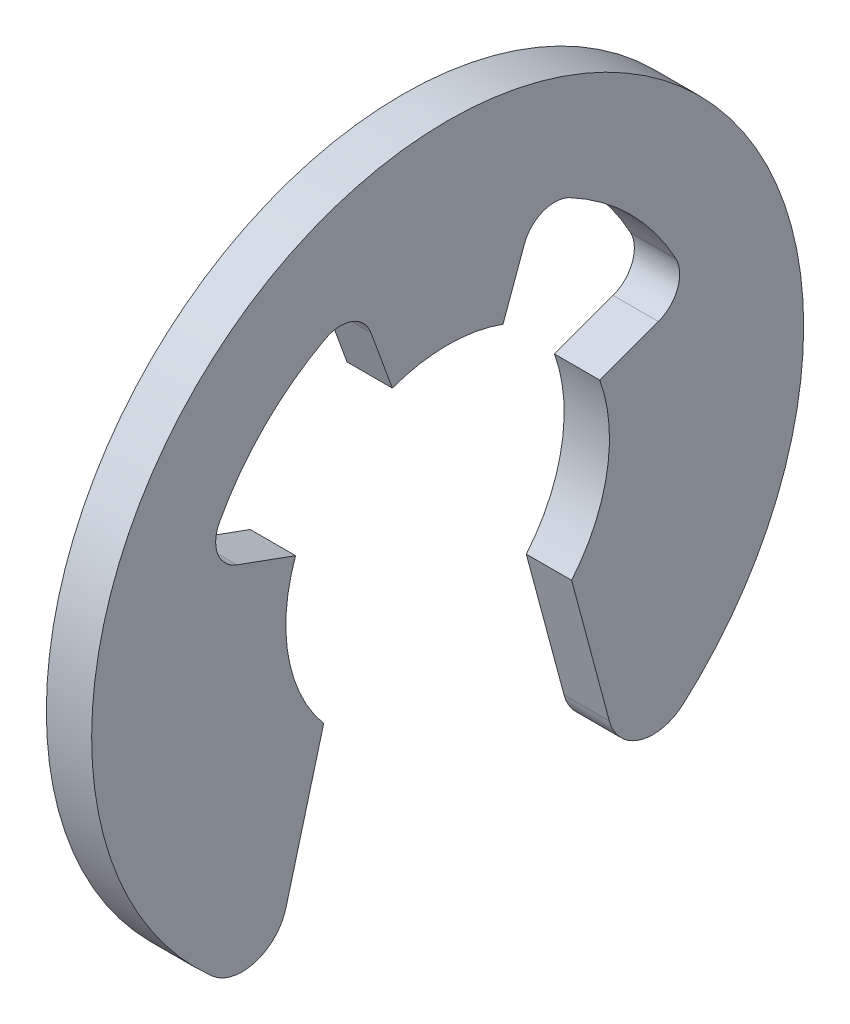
ISO-10303-21;
HEADER;
FILE_DESCRIPTION(('STEP AP214'),'2;1');
FILE_NAME('part.step','',(''),(''),'','','');
FILE_SCHEMA(('AUTOMOTIVE_DESIGN { 1 0 10303 214 1 1 1 1 }'));
ENDSEC;
DATA;
#1=APPLICATION_CONTEXT('core data for automotive mechanical design processes');
#2=APPLICATION_PROTOCOL_DEFINITION('international standard','automotive_design',2000,#1);
#3=PRODUCT_CONTEXT('',#1,'mechanical');
#4=PRODUCT('Part','Part','',(#3));
#5=PRODUCT_RELATED_PRODUCT_CATEGORY('part','',(#4));
#6=PRODUCT_DEFINITION_FORMATION('','',#4);
#7=PRODUCT_DEFINITION_CONTEXT('part definition',#1,'design');
#8=PRODUCT_DEFINITION('design','',#6,#7);
#9=PRODUCT_DEFINITION_SHAPE('','',#8);
#10=(LENGTH_UNIT() NAMED_UNIT(*) SI_UNIT(.MILLI.,.METRE.));
#11=(NAMED_UNIT(*) PLANE_ANGLE_UNIT() SI_UNIT($,.RADIAN.));
#12=(NAMED_UNIT(*) SI_UNIT($,.STERADIAN.) SOLID_ANGLE_UNIT());
#13=UNCERTAINTY_MEASURE_WITH_UNIT(LENGTH_MEASURE(1.E-05),#10,'distance_accuracy_value','');
#14=(GEOMETRIC_REPRESENTATION_CONTEXT(3) GLOBAL_UNCERTAINTY_ASSIGNED_CONTEXT((#13)) GLOBAL_UNIT_ASSIGNED_CONTEXT((#10,
#11,#12)) REPRESENTATION_CONTEXT('',''));
#15=CARTESIAN_POINT('',(0.,0.,0.));
#16=DIRECTION('',(0.,0.,1.));
#17=DIRECTION('',(1.,0.,0.));
#18=AXIS2_PLACEMENT_3D('',#15,#16,#17);
#19=CARTESIAN_POINT('',(0.7,0.,0.));
#20=DIRECTION('',(1.,0.,0.));
#21=DIRECTION('',(0.,0.,-1.));
#22=AXIS2_PLACEMENT_3D('',#19,#20,#21);
#23=PLANE('',#22);
#24=CARTESIAN_POINT('',(0.7,0.,0.));
#25=DIRECTION('',(1.,0.,0.));
#26=DIRECTION('',(0.,0.,-1.));
#27=AXIS2_PLACEMENT_3D('',#24,#25,#26);
#28=CIRCLE('',#27,4.);
#29=CARTESIAN_POINT('',(0.7,3.52477788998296,-1.89101581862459));
#30=VERTEX_POINT('',#29);
#31=CARTESIAN_POINT('',(0.7,1.89101581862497,-3.52477788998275));
#32=VERTEX_POINT('',#31);
#33=EDGE_CURVE('E153',#30,#32,#28,.F.);
#34=ORIENTED_EDGE('',*,*,#33,.T.);
#35=CARTESIAN_POINT('',(0.7,1.654638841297,-3.084180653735));
#36=DIRECTION('',(1.,0.,0.));
#37=DIRECTION('',(0.,0.,-1.));
#38=AXIS2_PLACEMENT_3D('',#35,#36,#37);
#39=CIRCLE('',#38,0.5);
#40=CARTESIAN_POINT('',(0.7,1.18479253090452,-3.25519072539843));
#41=VERTEX_POINT('',#40);
#42=EDGE_CURVE('E20',#32,#41,#39,.F.);
#43=ORIENTED_EDGE('',*,*,#42,.T.);
#44=DIRECTION('',(0.,-0.342020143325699,0.939692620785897));
#45=VECTOR('',#44,1.);
#46=CARTESIAN_POINT('',(0.7,1.184792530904,-3.255190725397));
#47=LINE('',#46,#45);
#48=CARTESIAN_POINT('',(0.7,0.85505035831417,-2.34923155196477));
#49=VERTEX_POINT('',#48);
#50=EDGE_CURVE('E140',#49,#41,#47,.F.);
#51=ORIENTED_EDGE('',*,*,#50,.F.);
#52=CARTESIAN_POINT('',(0.7,0.,0.));
#53=DIRECTION('',(1.,0.,0.));
#54=DIRECTION('',(0.,0.,-1.));
#55=AXIS2_PLACEMENT_3D('',#52,#53,#54);
#56=CIRCLE('',#55,2.5);
#57=CARTESIAN_POINT('',(0.7,-1.60696902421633,-1.91511110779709));
#58=VERTEX_POINT('',#57);
#59=EDGE_CURVE('E160',#49,#58,#56,.F.);
#60=ORIENTED_EDGE('',*,*,#59,.T.);
#61=DIRECTION('',(0.,-0.965925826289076,-0.258819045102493));
#62=VECTOR('',#61,1.);
#63=CARTESIAN_POINT('',(0.7,-1.606969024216,-1.915111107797));
#64=LINE('',#63,#62);
#65=CARTESIAN_POINT('',(0.7,-3.78193368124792,-2.49789113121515));
#66=VERTEX_POINT('',#65);
#67=EDGE_CURVE('E180',#66,#58,#64,.F.);
#68=ORIENTED_EDGE('',*,*,#67,.F.);
#69=CARTESIAN_POINT('',(0.7,-3.600760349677,-3.174039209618));
#70=DIRECTION('',(1.,0.,0.));
#71=DIRECTION('',(0.,0.,-1.));
#72=AXIS2_PLACEMENT_3D('',#69,#70,#71);
#73=CIRCLE('',#72,0.7);
#74=CARTESIAN_POINT('',(0.7,-4.12587123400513,-3.6369199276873));
#75=VERTEX_POINT('',#74);
#76=EDGE_CURVE('E242',#75,#66,#73,.F.);
#77=ORIENTED_EDGE('',*,*,#76,.F.);
#78=CARTESIAN_POINT('',(0.7,0.,0.));
#79=DIRECTION('',(1.,0.,0.));
#80=DIRECTION('',(0.,0.,-1.));
#81=AXIS2_PLACEMENT_3D('',#78,#79,#80);
#82=CIRCLE('',#81,5.5);
#83=CARTESIAN_POINT('',(0.7,-4.12587123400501,3.6369199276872));
#84=VERTEX_POINT('',#83);
#85=EDGE_CURVE('E239',#84,#75,#82,.F.);
#86=ORIENTED_EDGE('',*,*,#85,.F.);
#87=CARTESIAN_POINT('',(0.7,-3.600760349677,3.174039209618));
#88=DIRECTION('',(1.,0.,0.));
#89=DIRECTION('',(0.,0.,-1.));
#90=AXIS2_PLACEMENT_3D('',#87,#88,#89);
#91=CIRCLE('',#90,0.7);
#92=CARTESIAN_POINT('',(0.7,-3.7819336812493,2.49789113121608));
#93=VERTEX_POINT('',#92);
#94=EDGE_CURVE('E235',#93,#84,#91,.F.);
#95=ORIENTED_EDGE('',*,*,#94,.F.);
#96=DIRECTION('',(0.,0.965925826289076,-0.258819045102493));
#97=VECTOR('',#96,1.);
#98=CARTESIAN_POINT('',(0.7,-3.781933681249,2.497891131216));
#99=LINE('',#98,#97);
#100=CARTESIAN_POINT('',(0.7,-1.60696902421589,1.91511110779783));
#101=VERTEX_POINT('',#100);
#102=EDGE_CURVE('E176',#101,#93,#99,.F.);
#103=ORIENTED_EDGE('',*,*,#102,.F.);
#104=CARTESIAN_POINT('',(0.7,0.,0.));
#105=DIRECTION('',(1.,0.,0.));
#106=DIRECTION('',(0.,0.,-1.));
#107=AXIS2_PLACEMENT_3D('',#104,#105,#106);
#108=CIRCLE('',#107,2.5);
#109=CARTESIAN_POINT('',(0.7,0.855050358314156,2.34923155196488));
#110=VERTEX_POINT('',#109);
#111=EDGE_CURVE('E175',#101,#110,#108,.F.);
#112=ORIENTED_EDGE('',*,*,#111,.T.);
#113=DIRECTION('',(0.,0.342020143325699,0.939692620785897));
#114=VECTOR('',#113,1.);
#115=CARTESIAN_POINT('',(0.7,0.8550503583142,2.349231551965));
#116=LINE('',#115,#114);
#117=CARTESIAN_POINT('',(0.7,1.18479253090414,3.25519072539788));
#118=VERTEX_POINT('',#117);
#119=EDGE_CURVE('E172',#118,#110,#116,.F.);
#120=ORIENTED_EDGE('',*,*,#119,.F.);
#121=CARTESIAN_POINT('',(0.7,1.654638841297,3.084180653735));
#122=DIRECTION('',(1.,0.,0.));
#123=DIRECTION('',(0.,0.,-1.));
#124=AXIS2_PLACEMENT_3D('',#121,#122,#123);
#125=CIRCLE('',#124,0.5);
#126=CARTESIAN_POINT('',(0.7,1.89101581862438,3.52477788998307));
#127=VERTEX_POINT('',#126);
#128=EDGE_CURVE('E229',#118,#127,#125,.F.);
#129=ORIENTED_EDGE('',*,*,#128,.T.);
#130=CARTESIAN_POINT('',(0.7,0.,0.));
#131=DIRECTION('',(1.,0.,0.));
#132=DIRECTION('',(0.,0.,-1.));
#133=AXIS2_PLACEMENT_3D('',#130,#131,#132);
#134=CIRCLE('',#133,4.);
#135=CARTESIAN_POINT('',(0.7,3.52477788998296,1.89101581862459));
#136=VERTEX_POINT('',#135);
#137=EDGE_CURVE('E226',#127,#136,#134,.F.);
#138=ORIENTED_EDGE('',*,*,#137,.T.);
#139=CARTESIAN_POINT('',(0.7,3.084180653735,1.654638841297));
#140=DIRECTION('',(1.,0.,0.));
#141=DIRECTION('',(0.,0.,-1.));
#142=AXIS2_PLACEMENT_3D('',#139,#140,#141);
#143=CIRCLE('',#142,0.5);
#144=CARTESIAN_POINT('',(0.7,3.25519072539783,1.1847925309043));
#145=VERTEX_POINT('',#144);
#146=EDGE_CURVE('E171',#136,#145,#143,.F.);
#147=ORIENTED_EDGE('',*,*,#146,.T.);
#148=DIRECTION('',(0.,-0.939692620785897,-0.342020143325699));
#149=VECTOR('',#148,1.);
#150=CARTESIAN_POINT('',(0.7,3.255190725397,1.184792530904));
#151=LINE('',#150,#149);
#152=CARTESIAN_POINT('',(0.7,2.34923155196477,0.85505035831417));
#153=VERTEX_POINT('',#152);
#154=EDGE_CURVE('E168',#153,#145,#151,.F.);
#155=ORIENTED_EDGE('',*,*,#154,.F.);
#156=CARTESIAN_POINT('',(0.7,0.,0.));
#157=DIRECTION('',(1.,0.,0.));
#158=DIRECTION('',(0.,0.,-1.));
#159=AXIS2_PLACEMENT_3D('',#156,#157,#158);
#160=CIRCLE('',#159,2.5);
#161=CARTESIAN_POINT('',(0.7,2.34923155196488,-0.855050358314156));
#162=VERTEX_POINT('',#161);
#163=EDGE_CURVE('E167',#153,#162,#160,.F.);
#164=ORIENTED_EDGE('',*,*,#163,.T.);
#165=DIRECTION('',(0.,0.939692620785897,-0.342020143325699));
#166=VECTOR('',#165,1.);
#167=CARTESIAN_POINT('',(0.7,2.349231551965,-0.8550503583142));
#168=LINE('',#167,#166);
#169=CARTESIAN_POINT('',(0.7,3.25519072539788,-1.18479253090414));
#170=VERTEX_POINT('',#169);
#171=EDGE_CURVE('E164',#170,#162,#168,.F.);
#172=ORIENTED_EDGE('',*,*,#171,.F.);
#173=CARTESIAN_POINT('',(0.7,3.084180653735,-1.654638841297));
#174=DIRECTION('',(1.,0.,0.));
#175=DIRECTION('',(0.,0.,-1.));
#176=AXIS2_PLACEMENT_3D('',#173,#174,#175);
#177=CIRCLE('',#176,0.5);
#178=EDGE_CURVE('E217',#170,#30,#177,.F.);
#179=ORIENTED_EDGE('',*,*,#178,.T.);
#180=EDGE_LOOP('',(#34,#43,#51,#60,#68,#77,#86,#95,#103,#112,#120,#129,#138,#147,#155,#164,#172,#179));
#181=FACE_BOUND('',#180,.T.);
#182=ADVANCED_FACE('F16',(#181),#23,.T.);
#183=CARTESIAN_POINT('',(0.,1.654638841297,-3.084180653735));
#184=DIRECTION('',(1.,0.,0.));
#185=DIRECTION('',(0.,0.,-1.));
#186=AXIS2_PLACEMENT_3D('',#183,#184,#185);
#187=CYLINDRICAL_SURFACE('',#186,0.5);
#188=ORIENTED_EDGE('',*,*,#42,.F.);
#189=DIRECTION('',(1.,0.,0.));
#190=VECTOR('',#189,1.);
#191=CARTESIAN_POINT('',(0.,1.89101581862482,-3.52477788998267));
#192=LINE('',#191,#190);
#193=CARTESIAN_POINT('',(0.,1.89101581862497,-3.52477788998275));
#194=VERTEX_POINT('',#193);
#195=EDGE_CURVE('E215',#32,#194,#192,.F.);
#196=ORIENTED_EDGE('',*,*,#195,.T.);
#197=CARTESIAN_POINT('',(0.,1.654638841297,-3.084180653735));
#198=DIRECTION('',(1.,0.,0.));
#199=DIRECTION('',(0.,0.,-1.));
#200=AXIS2_PLACEMENT_3D('',#197,#198,#199);
#201=CIRCLE('',#200,0.5);
#202=CARTESIAN_POINT('',(0.,1.18479253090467,-3.25519072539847));
#203=VERTEX_POINT('',#202);
#204=EDGE_CURVE('E158',#194,#203,#201,.F.);
#205=ORIENTED_EDGE('',*,*,#204,.T.);
#206=DIRECTION('',(1.,0.,0.));
#207=VECTOR('',#206,1.);
#208=CARTESIAN_POINT('',(0.,1.18479253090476,-3.25519072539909));
#209=LINE('',#208,#207);
#210=EDGE_CURVE('E145',#41,#203,#209,.F.);
#211=ORIENTED_EDGE('',*,*,#210,.F.);
#212=EDGE_LOOP('',(#188,#196,#205,#211));
#213=FACE_BOUND('',#212,.T.);
#214=ADVANCED_FACE('F157',(#213),#187,.F.);
#215=CARTESIAN_POINT('',(0.,1.184792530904,-3.255190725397));
#216=DIRECTION('',(0.,0.939692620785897,0.342020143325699));
#217=DIRECTION('',(0.,-0.342020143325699,0.939692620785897));
#218=AXIS2_PLACEMENT_3D('',#215,#216,#217);
#219=PLANE('',#218);
#220=ORIENTED_EDGE('',*,*,#210,.T.);
#221=DIRECTION('',(0.,-0.342020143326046,0.939692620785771));
#222=VECTOR('',#221,1.);
#223=CARTESIAN_POINT('',(0.,1.184792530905,-3.255190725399));
#224=LINE('',#223,#222);
#225=CARTESIAN_POINT('',(0.,0.855050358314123,-2.34923155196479));
#226=VERTEX_POINT('',#225);
#227=EDGE_CURVE('E213',#203,#226,#224,.T.);
#228=ORIENTED_EDGE('',*,*,#227,.T.);
#229=DIRECTION('',(1.,0.,0.));
#230=VECTOR('',#229,1.);
#231=CARTESIAN_POINT('',(0.,0.855050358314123,-2.34923155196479));
#232=LINE('',#231,#230);
#233=EDGE_CURVE('E147',#226,#49,#232,.T.);
#234=ORIENTED_EDGE('',*,*,#233,.T.);
#235=ORIENTED_EDGE('',*,*,#50,.T.);
#236=EDGE_LOOP('',(#220,#228,#234,#235));
#237=FACE_BOUND('',#236,.T.);
#238=ADVANCED_FACE('F142',(#237),#219,.T.);
#239=CARTESIAN_POINT('',(0.,0.,0.));
#240=DIRECTION('',(1.,0.,0.));
#241=DIRECTION('',(0.,0.,-1.));
#242=AXIS2_PLACEMENT_3D('',#239,#240,#241);
#243=CYLINDRICAL_SURFACE('',#242,2.5);
#244=ORIENTED_EDGE('',*,*,#59,.F.);
#245=ORIENTED_EDGE('',*,*,#233,.F.);
#246=CARTESIAN_POINT('',(0.,0.,0.));
#247=DIRECTION('',(1.,0.,0.));
#248=DIRECTION('',(0.,0.,-1.));
#249=AXIS2_PLACEMENT_3D('',#246,#247,#248);
#250=CIRCLE('',#249,2.5);
#251=CARTESIAN_POINT('',(0.,-1.60696902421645,-1.91511110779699));
#252=VERTEX_POINT('',#251);
#253=EDGE_CURVE('E211',#226,#252,#250,.F.);
#254=ORIENTED_EDGE('',*,*,#253,.T.);
#255=DIRECTION('',(1.,0.,0.));
#256=VECTOR('',#255,1.);
#257=CARTESIAN_POINT('',(0.,-1.606969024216,-1.915111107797));
#258=LINE('',#257,#256);
#259=EDGE_CURVE('E181',#58,#252,#258,.F.);
#260=ORIENTED_EDGE('',*,*,#259,.F.);
#261=EDGE_LOOP('',(#244,#245,#254,#260));
#262=FACE_BOUND('',#261,.T.);
#263=ADVANCED_FACE('F249',(#262),#243,.F.);
#264=CARTESIAN_POINT('',(0.,-1.606969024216,-1.915111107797));
#265=DIRECTION('',(0.,-0.258819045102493,0.965925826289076));
#266=DIRECTION('',(0.,-0.965925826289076,-0.258819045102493));
#267=AXIS2_PLACEMENT_3D('',#264,#265,#266);
#268=PLANE('',#267);
#269=ORIENTED_EDGE('',*,*,#259,.T.);
#270=DIRECTION('',(0.,-0.965925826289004,-0.25881904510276));
#271=VECTOR('',#270,1.);
#272=CARTESIAN_POINT('',(0.,-1.606969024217,-1.915111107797));
#273=LINE('',#272,#271);
#274=CARTESIAN_POINT('',(0.,-3.78193368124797,-2.49789113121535));
#275=VERTEX_POINT('',#274);
#276=EDGE_CURVE('E210',#252,#275,#273,.T.);
#277=ORIENTED_EDGE('',*,*,#276,.T.);
#278=DIRECTION('',(1.,0.,0.));
#279=VECTOR('',#278,1.);
#280=CARTESIAN_POINT('',(0.,-3.78193368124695,-2.49789113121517));
#281=LINE('',#280,#279);
#282=EDGE_CURVE('E241',#66,#275,#281,.F.);
#283=ORIENTED_EDGE('',*,*,#282,.F.);
#284=ORIENTED_EDGE('',*,*,#67,.T.);
#285=EDGE_LOOP('',(#269,#277,#283,#284));
#286=FACE_BOUND('',#285,.T.);
#287=ADVANCED_FACE('F336',(#286),#268,.T.);
#288=CARTESIAN_POINT('',(0.,-3.600760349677,-3.174039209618));
#289=DIRECTION('',(1.,0.,0.));
#290=DIRECTION('',(0.,0.,-1.));
#291=AXIS2_PLACEMENT_3D('',#288,#289,#290);
#292=CYLINDRICAL_SURFACE('',#291,0.7);
#293=ORIENTED_EDGE('',*,*,#282,.T.);
#294=CARTESIAN_POINT('',(0.,-3.600760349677,-3.174039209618));
#295=DIRECTION('',(1.,0.,0.));
#296=DIRECTION('',(0.,0.,-1.));
#297=AXIS2_PLACEMENT_3D('',#294,#295,#296);
#298=CIRCLE('',#297,0.7);
#299=CARTESIAN_POINT('',(0.,-4.12587123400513,-3.6369199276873));
#300=VERTEX_POINT('',#299);
#301=EDGE_CURVE('E207',#275,#300,#298,.T.);
#302=ORIENTED_EDGE('',*,*,#301,.T.);
#303=DIRECTION('',(1.,0.,0.));
#304=VECTOR('',#303,1.);
#305=CARTESIAN_POINT('',(0.,-4.12587123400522,-3.63691992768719));
#306=LINE('',#305,#304);
#307=EDGE_CURVE('E238',#75,#300,#306,.F.);
#308=ORIENTED_EDGE('',*,*,#307,.F.);
#309=ORIENTED_EDGE('',*,*,#76,.T.);
#310=EDGE_LOOP('',(#293,#302,#308,#309));
#311=FACE_BOUND('',#310,.T.);
#312=ADVANCED_FACE('F335',(#311),#292,.T.);
#313=CARTESIAN_POINT('',(0.,0.,0.));
#314=DIRECTION('',(1.,0.,0.));
#315=DIRECTION('',(0.,0.,-1.));
#316=AXIS2_PLACEMENT_3D('',#313,#314,#315);
#317=CYLINDRICAL_SURFACE('',#316,5.5);
#318=CARTESIAN_POINT('',(0.,0.,0.));
#319=DIRECTION('',(1.,0.,0.));
#320=DIRECTION('',(0.,0.,-1.));
#321=AXIS2_PLACEMENT_3D('',#318,#319,#320);
#322=CIRCLE('',#321,5.5);
#323=CARTESIAN_POINT('',(0.,-4.12587123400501,3.6369199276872));
#324=VERTEX_POINT('',#323);
#325=EDGE_CURVE('E205',#300,#324,#322,.T.);
#326=ORIENTED_EDGE('',*,*,#325,.T.);
#327=DIRECTION('',(1.,0.,0.));
#328=VECTOR('',#327,1.);
#329=CARTESIAN_POINT('',(0.,-4.1258712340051,3.63691992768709));
#330=LINE('',#329,#328);
#331=EDGE_CURVE('E179',#84,#324,#330,.F.);
#332=ORIENTED_EDGE('',*,*,#331,.F.);
#333=ORIENTED_EDGE('',*,*,#85,.T.);
#334=ORIENTED_EDGE('',*,*,#307,.T.);
#335=EDGE_LOOP('',(#326,#332,#333,#334));
#336=FACE_BOUND('',#335,.T.);
#337=ADVANCED_FACE('F369',(#336),#317,.T.);
#338=CARTESIAN_POINT('',(0.,-3.600760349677,3.174039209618));
#339=DIRECTION('',(1.,0.,0.));
#340=DIRECTION('',(0.,0.,-1.));
#341=AXIS2_PLACEMENT_3D('',#338,#339,#340);
#342=CYLINDRICAL_SURFACE('',#341,0.7);
#343=ORIENTED_EDGE('',*,*,#331,.T.);
#344=CARTESIAN_POINT('',(0.,-3.600760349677,3.174039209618));
#345=DIRECTION('',(1.,0.,0.));
#346=DIRECTION('',(0.,0.,-1.));
#347=AXIS2_PLACEMENT_3D('',#344,#345,#346);
#348=CIRCLE('',#347,0.7);
#349=CARTESIAN_POINT('',(0.,-3.78193368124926,2.49789113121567));
#350=VERTEX_POINT('',#349);
#351=EDGE_CURVE('E202',#324,#350,#348,.T.);
#352=ORIENTED_EDGE('',*,*,#351,.T.);
#353=DIRECTION('',(1.,0.,0.));
#354=VECTOR('',#353,1.);
#355=CARTESIAN_POINT('',(0.,-3.78193368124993,2.49789113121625));
#356=LINE('',#355,#354);
#357=EDGE_CURVE('E178',#93,#350,#356,.F.);
#358=ORIENTED_EDGE('',*,*,#357,.F.);
#359=ORIENTED_EDGE('',*,*,#94,.T.);
#360=EDGE_LOOP('',(#343,#352,#358,#359));
#361=FACE_BOUND('',#360,.T.);
#362=ADVANCED_FACE('F328',(#361),#342,.T.);
#363=CARTESIAN_POINT('',(0.,-3.781933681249,2.497891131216));
#364=DIRECTION('',(0.,-0.258819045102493,-0.965925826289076));
#365=DIRECTION('',(0.,0.965925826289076,-0.258819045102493));
#366=AXIS2_PLACEMENT_3D('',#363,#364,#365);
#367=PLANE('',#366);
#368=ORIENTED_EDGE('',*,*,#357,.T.);
#369=DIRECTION('',(0.,0.965925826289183,-0.258819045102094));
#370=VECTOR('',#369,1.);
#371=CARTESIAN_POINT('',(0.,-3.781933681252,2.497891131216));
#372=LINE('',#371,#370);
#373=CARTESIAN_POINT('',(0.,-1.60696902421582,1.91511110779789));
#374=VERTEX_POINT('',#373);
#375=EDGE_CURVE('E201',#350,#374,#372,.T.);
#376=ORIENTED_EDGE('',*,*,#375,.T.);
#377=DIRECTION('',(1.,0.,0.));
#378=VECTOR('',#377,1.);
#379=CARTESIAN_POINT('',(0.,-1.60696902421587,1.91511110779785));
#380=LINE('',#379,#378);
#381=EDGE_CURVE('E234',#374,#101,#380,.T.);
#382=ORIENTED_EDGE('',*,*,#381,.T.);
#383=ORIENTED_EDGE('',*,*,#102,.T.);
#384=EDGE_LOOP('',(#368,#376,#382,#383));
#385=FACE_BOUND('',#384,.T.);
#386=ADVANCED_FACE('F324',(#385),#367,.T.);
#387=CARTESIAN_POINT('',(0.,0.,0.));
#388=DIRECTION('',(1.,0.,0.));
#389=DIRECTION('',(0.,0.,-1.));
#390=AXIS2_PLACEMENT_3D('',#387,#388,#389);
#391=CYLINDRICAL_SURFACE('',#390,2.5);
#392=ORIENTED_EDGE('',*,*,#111,.F.);
#393=ORIENTED_EDGE('',*,*,#381,.F.);
#394=CARTESIAN_POINT('',(0.,0.,0.));
#395=DIRECTION('',(1.,0.,0.));
#396=DIRECTION('',(0.,0.,-1.));
#397=AXIS2_PLACEMENT_3D('',#394,#395,#396);
#398=CIRCLE('',#397,2.5);
#399=CARTESIAN_POINT('',(0.,0.855050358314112,2.34923155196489));
#400=VERTEX_POINT('',#399);
#401=EDGE_CURVE('E199',#374,#400,#398,.F.);
#402=ORIENTED_EDGE('',*,*,#401,.T.);
#403=DIRECTION('',(1.,0.,0.));
#404=VECTOR('',#403,1.);
#405=CARTESIAN_POINT('',(0.,0.855050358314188,2.34923155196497));
#406=LINE('',#405,#404);
#407=EDGE_CURVE('E174',#110,#400,#406,.F.);
#408=ORIENTED_EDGE('',*,*,#407,.F.);
#409=EDGE_LOOP('',(#392,#393,#402,#408));
#410=FACE_BOUND('',#409,.T.);
#411=ADVANCED_FACE('F319',(#410),#391,.F.);
#412=CARTESIAN_POINT('',(0.,0.8550503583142,2.349231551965));
#413=DIRECTION('',(0.,0.939692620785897,-0.342020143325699));
#414=DIRECTION('',(0.,0.342020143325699,0.939692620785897));
#415=AXIS2_PLACEMENT_3D('',#412,#413,#414);
#416=PLANE('',#415);
#417=ORIENTED_EDGE('',*,*,#407,.T.);
#418=DIRECTION('',(0.,0.342020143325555,0.93969262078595));
#419=VECTOR('',#418,1.);
#420=CARTESIAN_POINT('',(0.,0.8550503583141,2.349231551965));
#421=LINE('',#420,#419);
#422=CARTESIAN_POINT('',(0.,1.18479253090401,3.25519072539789));
#423=VERTEX_POINT('',#422);
#424=EDGE_CURVE('E198',#400,#423,#421,.T.);
#425=ORIENTED_EDGE('',*,*,#424,.T.);
#426=DIRECTION('',(1.,0.,0.));
#427=VECTOR('',#426,1.);
#428=CARTESIAN_POINT('',(0.,1.18479253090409,3.25519072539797));
#429=LINE('',#428,#427);
#430=EDGE_CURVE('E231',#423,#118,#429,.T.);
#431=ORIENTED_EDGE('',*,*,#430,.T.);
#432=ORIENTED_EDGE('',*,*,#119,.T.);
#433=EDGE_LOOP('',(#417,#425,#431,#432));
#434=FACE_BOUND('',#433,.T.);
#435=ADVANCED_FACE('F315',(#434),#416,.T.);
#436=CARTESIAN_POINT('',(0.,1.654638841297,3.084180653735));
#437=DIRECTION('',(1.,0.,0.));
#438=DIRECTION('',(0.,0.,-1.));
#439=AXIS2_PLACEMENT_3D('',#436,#437,#438);
#440=CYLINDRICAL_SURFACE('',#439,0.5);
#441=ORIENTED_EDGE('',*,*,#128,.F.);
#442=ORIENTED_EDGE('',*,*,#430,.F.);
#443=CARTESIAN_POINT('',(0.,1.654638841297,3.084180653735));
#444=DIRECTION('',(1.,0.,0.));
#445=DIRECTION('',(0.,0.,-1.));
#446=AXIS2_PLACEMENT_3D('',#443,#444,#445);
#447=CIRCLE('',#446,0.5);
#448=CARTESIAN_POINT('',(0.,1.89101581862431,3.52477788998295));
#449=VERTEX_POINT('',#448);
#450=EDGE_CURVE('E196',#423,#449,#447,.F.);
#451=ORIENTED_EDGE('',*,*,#450,.T.);
#452=DIRECTION('',(1.,0.,0.));
#453=VECTOR('',#452,1.);
#454=CARTESIAN_POINT('',(0.,1.89101581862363,3.52477788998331));
#455=LINE('',#454,#453);
#456=EDGE_CURVE('E228',#449,#127,#455,.T.);
#457=ORIENTED_EDGE('',*,*,#456,.T.);
#458=EDGE_LOOP('',(#441,#442,#451,#457));
#459=FACE_BOUND('',#458,.T.);
#460=ADVANCED_FACE('F358',(#459),#440,.F.);
#461=CARTESIAN_POINT('',(0.,0.,0.));
#462=DIRECTION('',(1.,0.,0.));
#463=DIRECTION('',(0.,0.,-1.));
#464=AXIS2_PLACEMENT_3D('',#461,#462,#463);
#465=CYLINDRICAL_SURFACE('',#464,4.);
#466=ORIENTED_EDGE('',*,*,#137,.F.);
#467=ORIENTED_EDGE('',*,*,#456,.F.);
#468=CARTESIAN_POINT('',(0.,0.,0.));
#469=DIRECTION('',(1.,0.,0.));
#470=DIRECTION('',(0.,0.,-1.));
#471=AXIS2_PLACEMENT_3D('',#468,#469,#470);
#472=CIRCLE('',#471,4.);
#473=CARTESIAN_POINT('',(0.,3.52477788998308,1.89101581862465));
#474=VERTEX_POINT('',#473);
#475=EDGE_CURVE('E193',#449,#474,#472,.F.);
#476=ORIENTED_EDGE('',*,*,#475,.T.);
#477=DIRECTION('',(1.,0.,0.));
#478=VECTOR('',#477,1.);
#479=CARTESIAN_POINT('',(0.,3.52477788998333,1.89101581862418));
#480=LINE('',#479,#478);
#481=EDGE_CURVE('E225',#474,#136,#480,.T.);
#482=ORIENTED_EDGE('',*,*,#481,.T.);
#483=EDGE_LOOP('',(#466,#467,#476,#482));
#484=FACE_BOUND('',#483,.T.);
#485=ADVANCED_FACE('F308',(#484),#465,.F.);
#486=CARTESIAN_POINT('',(0.,3.084180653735,1.654638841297));
#487=DIRECTION('',(1.,0.,0.));
#488=DIRECTION('',(0.,0.,-1.));
#489=AXIS2_PLACEMENT_3D('',#486,#487,#488);
#490=CYLINDRICAL_SURFACE('',#489,0.5);
#491=ORIENTED_EDGE('',*,*,#146,.F.);
#492=ORIENTED_EDGE('',*,*,#481,.F.);
#493=CARTESIAN_POINT('',(0.,3.084180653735,1.654638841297));
#494=DIRECTION('',(1.,0.,0.));
#495=DIRECTION('',(0.,0.,-1.));
#496=AXIS2_PLACEMENT_3D('',#493,#494,#495);
#497=CIRCLE('',#496,0.5);
#498=CARTESIAN_POINT('',(0.,3.25519072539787,1.18479253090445));
#499=VERTEX_POINT('',#498);
#500=EDGE_CURVE('E190',#474,#499,#497,.F.);
#501=ORIENTED_EDGE('',*,*,#500,.T.);
#502=DIRECTION('',(1.,0.,0.));
#503=VECTOR('',#502,1.);
#504=CARTESIAN_POINT('',(0.,3.25519072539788,1.18479253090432));
#505=LINE('',#504,#503);
#506=EDGE_CURVE('E170',#145,#499,#505,.F.);
#507=ORIENTED_EDGE('',*,*,#506,.F.);
#508=EDGE_LOOP('',(#491,#492,#501,#507));
#509=FACE_BOUND('',#508,.T.);
#510=ADVANCED_FACE('F305',(#509),#490,.F.);
#511=CARTESIAN_POINT('',(0.,3.255190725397,1.184792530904));
#512=DIRECTION('',(0.,-0.342020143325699,0.939692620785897));
#513=DIRECTION('',(0.,-0.939692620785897,-0.342020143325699));
#514=AXIS2_PLACEMENT_3D('',#511,#512,#513);
#515=PLANE('',#514);
#516=ORIENTED_EDGE('',*,*,#506,.T.);
#517=DIRECTION('',(0.,-0.939692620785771,-0.342020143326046));
#518=VECTOR('',#517,1.);
#519=CARTESIAN_POINT('',(0.,3.255190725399,1.184792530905));
#520=LINE('',#519,#518);
#521=CARTESIAN_POINT('',(0.,2.34923155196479,0.855050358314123));
#522=VERTEX_POINT('',#521);
#523=EDGE_CURVE('E189',#499,#522,#520,.T.);
#524=ORIENTED_EDGE('',*,*,#523,.T.);
#525=DIRECTION('',(1.,0.,0.));
#526=VECTOR('',#525,1.);
#527=CARTESIAN_POINT('',(0.,2.34923155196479,0.855050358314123));
#528=LINE('',#527,#526);
#529=EDGE_CURVE('E222',#522,#153,#528,.T.);
#530=ORIENTED_EDGE('',*,*,#529,.T.);
#531=ORIENTED_EDGE('',*,*,#154,.T.);
#532=EDGE_LOOP('',(#516,#524,#530,#531));
#533=FACE_BOUND('',#532,.T.);
#534=ADVANCED_FACE('F299',(#533),#515,.T.);
#535=CARTESIAN_POINT('',(0.,0.,0.));
#536=DIRECTION('',(1.,0.,0.));
#537=DIRECTION('',(0.,0.,-1.));
#538=AXIS2_PLACEMENT_3D('',#535,#536,#537);
#539=CYLINDRICAL_SURFACE('',#538,2.5);
#540=ORIENTED_EDGE('',*,*,#163,.F.);
#541=ORIENTED_EDGE('',*,*,#529,.F.);
#542=CARTESIAN_POINT('',(0.,0.,0.));
#543=DIRECTION('',(1.,0.,0.));
#544=DIRECTION('',(0.,0.,-1.));
#545=AXIS2_PLACEMENT_3D('',#542,#543,#544);
#546=CIRCLE('',#545,2.5);
#547=CARTESIAN_POINT('',(0.,2.34923155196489,-0.855050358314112));
#548=VERTEX_POINT('',#547);
#549=EDGE_CURVE('E186',#522,#548,#546,.F.);
#550=ORIENTED_EDGE('',*,*,#549,.T.);
#551=DIRECTION('',(1.,0.,0.));
#552=VECTOR('',#551,1.);
#553=CARTESIAN_POINT('',(0.,2.34923155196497,-0.855050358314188));
#554=LINE('',#553,#552);
#555=EDGE_CURVE('E166',#162,#548,#554,.F.);
#556=ORIENTED_EDGE('',*,*,#555,.F.);
#557=EDGE_LOOP('',(#540,#541,#550,#556));
#558=FACE_BOUND('',#557,.T.);
#559=ADVANCED_FACE('F297',(#558),#539,.F.);
#560=CARTESIAN_POINT('',(0.,2.349231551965,-0.8550503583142));
#561=DIRECTION('',(0.,-0.342020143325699,-0.939692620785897));
#562=DIRECTION('',(0.,0.939692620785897,-0.342020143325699));
#563=AXIS2_PLACEMENT_3D('',#560,#561,#562);
#564=PLANE('',#563);
#565=ORIENTED_EDGE('',*,*,#555,.T.);
#566=DIRECTION('',(0.,0.93969262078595,-0.342020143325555));
#567=VECTOR('',#566,1.);
#568=CARTESIAN_POINT('',(0.,2.349231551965,-0.8550503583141));
#569=LINE('',#568,#567);
#570=CARTESIAN_POINT('',(0.,3.25519072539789,-1.18479253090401));
#571=VERTEX_POINT('',#570);
#572=EDGE_CURVE('E185',#548,#571,#569,.T.);
#573=ORIENTED_EDGE('',*,*,#572,.T.);
#574=DIRECTION('',(1.,0.,0.));
#575=VECTOR('',#574,1.);
#576=CARTESIAN_POINT('',(0.,3.25519072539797,-1.18479253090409));
#577=LINE('',#576,#575);
#578=EDGE_CURVE('E219',#571,#170,#577,.T.);
#579=ORIENTED_EDGE('',*,*,#578,.T.);
#580=ORIENTED_EDGE('',*,*,#171,.T.);
#581=EDGE_LOOP('',(#565,#573,#579,#580));
#582=FACE_BOUND('',#581,.T.);
#583=ADVANCED_FACE('F289',(#582),#564,.T.);
#584=CARTESIAN_POINT('',(0.,3.084180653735,-1.654638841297));
#585=DIRECTION('',(1.,0.,0.));
#586=DIRECTION('',(0.,0.,-1.));
#587=AXIS2_PLACEMENT_3D('',#584,#585,#586);
#588=CYLINDRICAL_SURFACE('',#587,0.5);
#589=ORIENTED_EDGE('',*,*,#178,.F.);
#590=ORIENTED_EDGE('',*,*,#578,.F.);
#591=CARTESIAN_POINT('',(0.,3.084180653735,-1.654638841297));
#592=DIRECTION('',(1.,0.,0.));
#593=DIRECTION('',(0.,0.,-1.));
#594=AXIS2_PLACEMENT_3D('',#591,#592,#593);
#595=CIRCLE('',#594,0.5);
#596=CARTESIAN_POINT('',(0.,3.52477788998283,-1.89101581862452));
#597=VERTEX_POINT('',#596);
#598=EDGE_CURVE('E26',#571,#597,#595,.F.);
#599=ORIENTED_EDGE('',*,*,#598,.T.);
#600=DIRECTION('',(1.,0.,0.));
#601=VECTOR('',#600,1.);
#602=CARTESIAN_POINT('',(0.,3.52477788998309,-1.89101581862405));
#603=LINE('',#602,#601);
#604=EDGE_CURVE('E34',#597,#30,#603,.T.);
#605=ORIENTED_EDGE('',*,*,#604,.T.);
#606=EDGE_LOOP('',(#589,#590,#599,#605));
#607=FACE_BOUND('',#606,.T.);
#608=ADVANCED_FACE('F339',(#607),#588,.F.);
#609=CARTESIAN_POINT('',(0.,0.,0.));
#610=DIRECTION('',(1.,0.,0.));
#611=DIRECTION('',(0.,0.,-1.));
#612=AXIS2_PLACEMENT_3D('',#609,#610,#611);
#613=CYLINDRICAL_SURFACE('',#612,4.);
#614=ORIENTED_EDGE('',*,*,#33,.F.);
#615=ORIENTED_EDGE('',*,*,#604,.F.);
#616=CARTESIAN_POINT('',(0.,0.,0.));
#617=DIRECTION('',(1.,0.,0.));
#618=DIRECTION('',(0.,0.,-1.));
#619=AXIS2_PLACEMENT_3D('',#616,#617,#618);
#620=CIRCLE('',#619,4.);
#621=EDGE_CURVE('E11',#597,#194,#620,.F.);
#622=ORIENTED_EDGE('',*,*,#621,.T.);
#623=ORIENTED_EDGE('',*,*,#195,.F.);
#624=EDGE_LOOP('',(#614,#615,#622,#623));
#625=FACE_BOUND('',#624,.T.);
#626=ADVANCED_FACE('F337',(#625),#613,.F.);
#627=CARTESIAN_POINT('',(0.,0.,0.));
#628=DIRECTION('',(1.,0.,0.));
#629=DIRECTION('',(0.,0.,-1.));
#630=AXIS2_PLACEMENT_3D('',#627,#628,#629);
#631=PLANE('',#630);
#632=ORIENTED_EDGE('',*,*,#598,.F.);
#633=ORIENTED_EDGE('',*,*,#572,.F.);
#634=ORIENTED_EDGE('',*,*,#549,.F.);
#635=ORIENTED_EDGE('',*,*,#523,.F.);
#636=ORIENTED_EDGE('',*,*,#500,.F.);
#637=ORIENTED_EDGE('',*,*,#475,.F.);
#638=ORIENTED_EDGE('',*,*,#450,.F.);
#639=ORIENTED_EDGE('',*,*,#424,.F.);
#640=ORIENTED_EDGE('',*,*,#401,.F.);
#641=ORIENTED_EDGE('',*,*,#375,.F.);
#642=ORIENTED_EDGE('',*,*,#351,.F.);
#643=ORIENTED_EDGE('',*,*,#325,.F.);
#644=ORIENTED_EDGE('',*,*,#301,.F.);
#645=ORIENTED_EDGE('',*,*,#276,.F.);
#646=ORIENTED_EDGE('',*,*,#253,.F.);
#647=ORIENTED_EDGE('',*,*,#227,.F.);
#648=ORIENTED_EDGE('',*,*,#204,.F.);
#649=ORIENTED_EDGE('',*,*,#621,.F.);
#650=EDGE_LOOP('',(#632,#633,#634,#635,#636,#637,#638,#639,#640,#641,#642,#643,#644,#645,#646,
#647,#648,#649));
#651=FACE_BOUND('',#650,.T.);
#652=ADVANCED_FACE('F18',(#651),#631,.F.);
#653=CLOSED_SHELL('',(#182,#214,#238,#263,#287,#312,#337,#362,#386,#411,#435,#460,#485,#510,
#534,#559,#583,#608,#626,#652));
#654=MANIFOLD_SOLID_BREP('B1',#653);
#655=ADVANCED_BREP_SHAPE_REPRESENTATION('',(#18,#654),#14);
#656=SHAPE_DEFINITION_REPRESENTATION(#9,#655);
ENDSEC;
END-ISO-10303-21;
